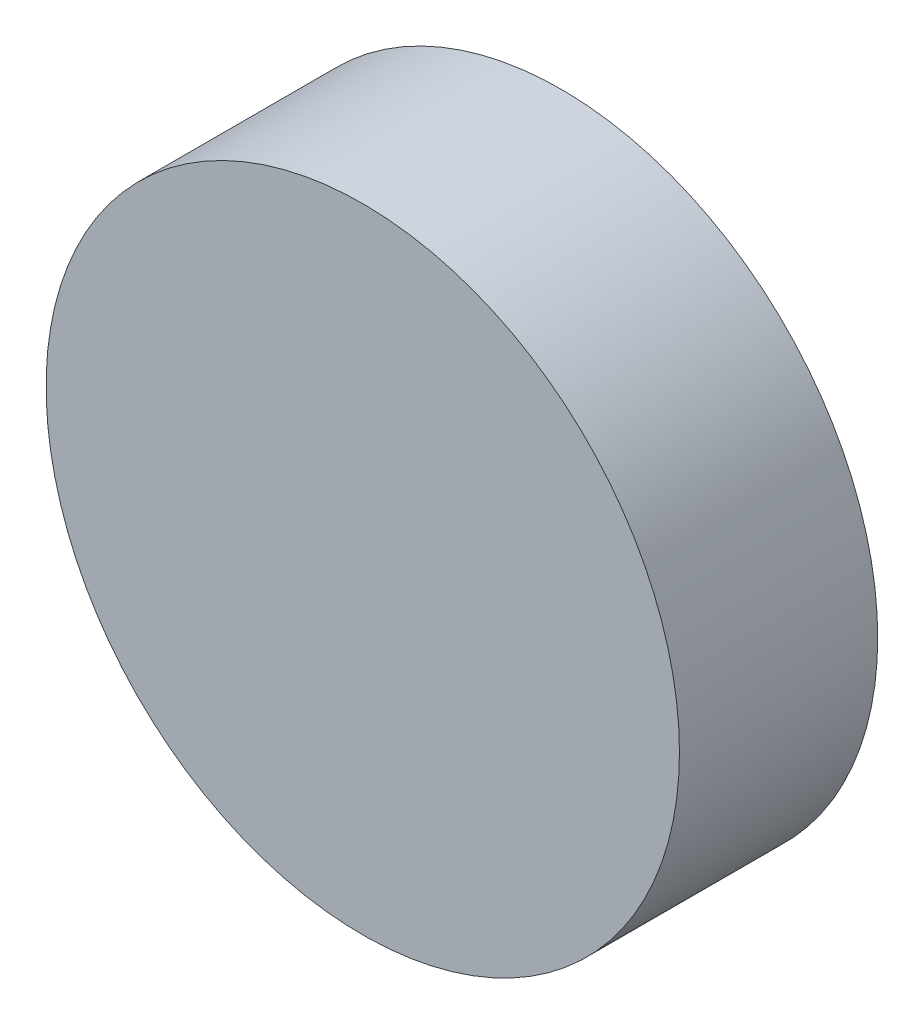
from build123d import *

# Parameters (mm, degrees)
SKETCH1_R           = 73.025
BOSS_EXTRUDE1_DEPTH = 45.72


with BuildPart() as part:
    # Sketch1 → Boss-Extrude1 (new body)
    with BuildSketch(Plane.XY):
        Circle(SKETCH1_R)
    extrude(amount=BOSS_EXTRUDE1_DEPTH)


solid = part.part
